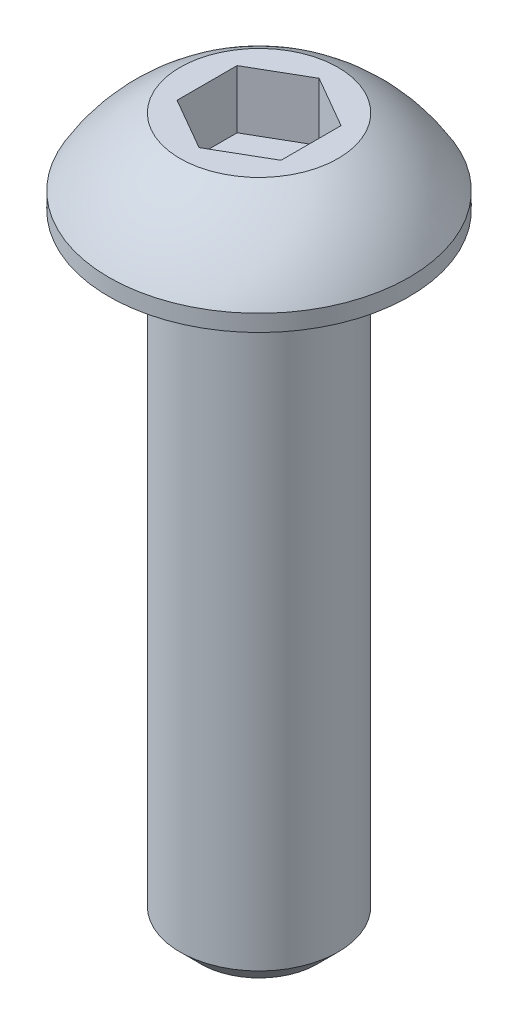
from build123d import *

# Parameters (mm, degrees)
CUT_EXTRUDE1_DEPTH = 1.778


with BuildPart() as part:
    # Sketch1 → Base-Revolve (revolve)
    with BuildSketch(Plane.XY, mode=Mode.PRIVATE) as base_revolve_sk:
        with BuildLine():
            Line((0, 0), (4.5847, 0))
            Line((4.5847, 0), (4.5847, 0.508))
            ThreePointArc((4.5847, 0.508), (3.6469405, 1.69301775), (2.413, 2.5654))
            Line((2.413, 2.5654), (0, 2.5654))
            Line((0, 2.5654), (0, 0))
        make_face()
    revolve(base_revolve_sk.sketch.rotate(Axis((0, 0, 0), (0, 1, 0)), 90), axis=Axis((0, 0, 0), (0, 1, 0)))

    # Sketch2 → Boss-Revolve1 (revolve)
    with BuildSketch(Plane.XY, mode=Mode.PRIVATE) as boss_revolve1_sk:
        Polygon((0, -19.05), (1.78308, -19.05), (2.413, -18.42008), (2.413, 0), (0, 0), align=None)
    revolve(boss_revolve1_sk.sketch.rotate(Axis((0, 0, 0), (0, 1, 0)), 90), axis=Axis((0, 0, 0), (0, 1, 0)))

    # Sketch3 → Cut-Extrude1 (cut)
    with BuildSketch(Plane(origin=(0, 2.5654, 0), x_dir=(-1, 0, 0), z_dir=(0, 1, 0))):
        Polygon((1.5875, 0.916543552), (0, 1.833087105), (-1.5875, 0.916543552), (-1.5875, -0.916543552), (0, -1.833087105), (1.5875, -0.916543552), align=None)
    extrude(amount=-CUT_EXTRUDE1_DEPTH, mode=Mode.SUBTRACT)


solid = part.part
